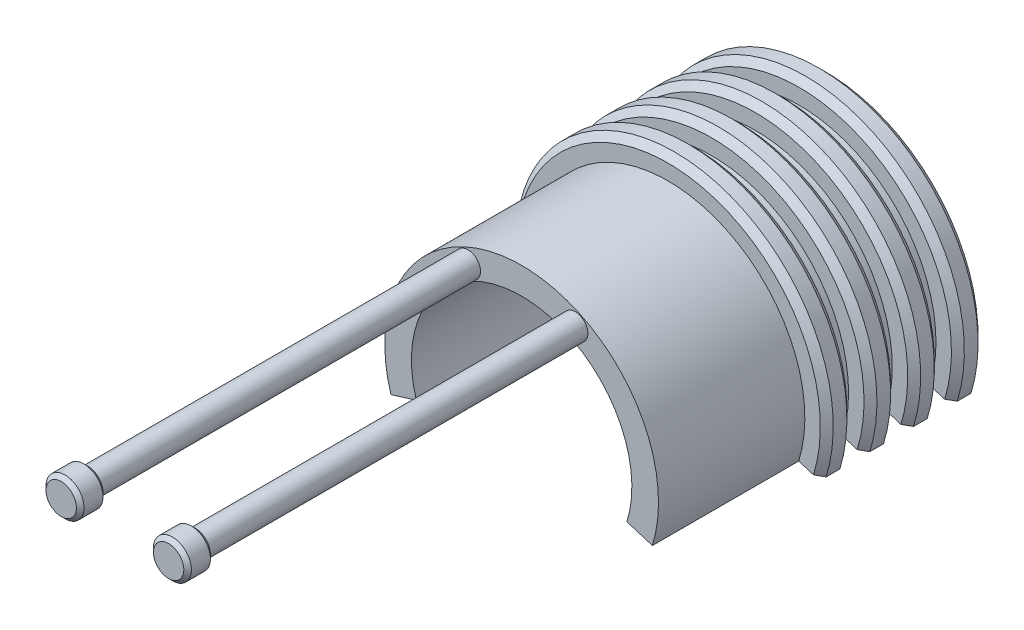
ISO-10303-21;
HEADER;
FILE_DESCRIPTION(('STEP AP214'),'2;1');
FILE_NAME('part.step','',(''),(''),'','','');
FILE_SCHEMA(('AUTOMOTIVE_DESIGN { 1 0 10303 214 1 1 1 1 }'));
ENDSEC;
DATA;
#1=APPLICATION_CONTEXT('core data for automotive mechanical design processes');
#2=APPLICATION_PROTOCOL_DEFINITION('international standard','automotive_design',2000,#1);
#3=PRODUCT_CONTEXT('',#1,'mechanical');
#4=PRODUCT('Part','Part','',(#3));
#5=PRODUCT_RELATED_PRODUCT_CATEGORY('part','',(#4));
#6=PRODUCT_DEFINITION_FORMATION('','',#4);
#7=PRODUCT_DEFINITION_CONTEXT('part definition',#1,'design');
#8=PRODUCT_DEFINITION('design','',#6,#7);
#9=PRODUCT_DEFINITION_SHAPE('','',#8);
#10=(LENGTH_UNIT() NAMED_UNIT(*) SI_UNIT(.MILLI.,.METRE.));
#11=(NAMED_UNIT(*) PLANE_ANGLE_UNIT() SI_UNIT($,.RADIAN.));
#12=(NAMED_UNIT(*) SI_UNIT($,.STERADIAN.) SOLID_ANGLE_UNIT());
#13=UNCERTAINTY_MEASURE_WITH_UNIT(LENGTH_MEASURE(1.E-05),#10,'distance_accuracy_value','');
#14=(GEOMETRIC_REPRESENTATION_CONTEXT(3) GLOBAL_UNCERTAINTY_ASSIGNED_CONTEXT((#13)) GLOBAL_UNIT_ASSIGNED_CONTEXT((#10,
#11,#12)) REPRESENTATION_CONTEXT('',''));
#15=CARTESIAN_POINT('',(0.,0.,0.));
#16=DIRECTION('',(0.,0.,1.));
#17=DIRECTION('',(1.,0.,0.));
#18=AXIS2_PLACEMENT_3D('',#15,#16,#17);
#19=CARTESIAN_POINT('',(0.,0.,80.));
#20=DIRECTION('',(0.,0.,-1.));
#21=DIRECTION('',(-1.,0.,0.));
#22=AXIS2_PLACEMENT_3D('',#19,#20,#21);
#23=CYLINDRICAL_SURFACE('',#22,36.);
#24=CARTESIAN_POINT('',(0.,0.,41.5));
#25=DIRECTION('',(0.,0.,1.));
#26=DIRECTION('',(-1.,0.,0.));
#27=AXIS2_PLACEMENT_3D('',#24,#25,#26);
#28=CIRCLE('',#27,36.);
#29=CARTESIAN_POINT('',(34.3887413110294,-10.6496230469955,41.5));
#30=VERTEX_POINT('',#29);
#31=CARTESIAN_POINT('',(-34.3887413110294,-10.6496230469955,41.5));
#32=VERTEX_POINT('',#31);
#33=EDGE_CURVE('E221',#30,#32,#28,.T.);
#34=ORIENTED_EDGE('',*,*,#33,.T.);
#35=DIRECTION('',(0.,0.,-1.));
#36=VECTOR('',#35,1.);
#37=CARTESIAN_POINT('',(-34.3887413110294,-10.6496230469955,80.));
#38=LINE('',#37,#36);
#39=CARTESIAN_POINT('',(-34.3887413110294,-10.6496230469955,80.));
#40=VERTEX_POINT('',#39);
#41=EDGE_CURVE('E230',#40,#32,#38,.T.);
#42=ORIENTED_EDGE('',*,*,#41,.F.);
#43=CARTESIAN_POINT('',(0.,0.,80.));
#44=DIRECTION('',(0.,0.,1.));
#45=DIRECTION('',(1.,0.,0.));
#46=AXIS2_PLACEMENT_3D('',#43,#44,#45);
#47=CIRCLE('',#46,36.);
#48=CARTESIAN_POINT('',(34.3887413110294,-10.6496230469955,80.));
#49=VERTEX_POINT('',#48);
#50=EDGE_CURVE('E257',#49,#40,#47,.T.);
#51=ORIENTED_EDGE('',*,*,#50,.F.);
#52=DIRECTION('',(0.,0.,-1.));
#53=VECTOR('',#52,1.);
#54=CARTESIAN_POINT('',(34.3887413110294,-10.6496230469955,80.));
#55=LINE('',#54,#53);
#56=EDGE_CURVE('E233',#49,#30,#55,.T.);
#57=ORIENTED_EDGE('',*,*,#56,.T.);
#58=EDGE_LOOP('',(#34,#42,#51,#57));
#59=FACE_BOUND('',#58,.T.);
#60=ADVANCED_FACE('F44',(#59),#23,.T.);
#61=CARTESIAN_POINT('',(-34.3887413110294,-10.6496230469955,34.5));
#62=VERTEX_POINT('',#61);
#63=CARTESIAN_POINT('',(-34.3887413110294,-10.6496230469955,30.));
#64=VERTEX_POINT('',#63);
#65=EDGE_CURVE('E240',#62,#64,#38,.T.);
#66=ORIENTED_EDGE('',*,*,#65,.F.);
#67=CARTESIAN_POINT('',(0.,0.,34.5));
#68=DIRECTION('',(0.,0.,1.));
#69=DIRECTION('',(-1.,0.,0.));
#70=AXIS2_PLACEMENT_3D('',#67,#68,#69);
#71=CIRCLE('',#70,36.);
#72=CARTESIAN_POINT('',(34.3887413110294,-10.6496230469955,34.5));
#73=VERTEX_POINT('',#72);
#74=EDGE_CURVE('E348',#73,#62,#71,.T.);
#75=ORIENTED_EDGE('',*,*,#74,.F.);
#76=CARTESIAN_POINT('',(34.3887413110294,-10.6496230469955,30.));
#77=VERTEX_POINT('',#76);
#78=EDGE_CURVE('E503',#73,#77,#55,.T.);
#79=ORIENTED_EDGE('',*,*,#78,.T.);
#80=CARTESIAN_POINT('',(0.,0.,30.));
#81=DIRECTION('',(0.,0.,1.));
#82=DIRECTION('',(-1.,0.,0.));
#83=AXIS2_PLACEMENT_3D('',#80,#81,#82);
#84=CIRCLE('',#83,36.);
#85=EDGE_CURVE('E328',#77,#64,#84,.T.);
#86=ORIENTED_EDGE('',*,*,#85,.T.);
#87=EDGE_LOOP('',(#66,#75,#79,#86));
#88=FACE_BOUND('',#87,.T.);
#89=ADVANCED_FACE('F402',(#88),#23,.T.);
#90=CARTESIAN_POINT('',(-34.3887413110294,-10.6496230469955,23.));
#91=VERTEX_POINT('',#90);
#92=CARTESIAN_POINT('',(-34.3887413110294,-10.6496230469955,18.5));
#93=VERTEX_POINT('',#92);
#94=EDGE_CURVE('E245',#91,#93,#38,.T.);
#95=ORIENTED_EDGE('',*,*,#94,.F.);
#96=CARTESIAN_POINT('',(0.,0.,23.));
#97=DIRECTION('',(0.,0.,1.));
#98=DIRECTION('',(-1.,0.,0.));
#99=AXIS2_PLACEMENT_3D('',#96,#97,#98);
#100=CIRCLE('',#99,36.);
#101=CARTESIAN_POINT('',(34.3887413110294,-10.6496230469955,23.));
#102=VERTEX_POINT('',#101);
#103=EDGE_CURVE('E332',#102,#91,#100,.T.);
#104=ORIENTED_EDGE('',*,*,#103,.F.);
#105=CARTESIAN_POINT('',(34.3887413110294,-10.6496230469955,18.5));
#106=VERTEX_POINT('',#105);
#107=EDGE_CURVE('E243',#102,#106,#55,.T.);
#108=ORIENTED_EDGE('',*,*,#107,.T.);
#109=CARTESIAN_POINT('',(0.,0.,18.5));
#110=DIRECTION('',(0.,0.,1.));
#111=DIRECTION('',(-1.,0.,0.));
#112=AXIS2_PLACEMENT_3D('',#109,#110,#111);
#113=CIRCLE('',#112,36.);
#114=EDGE_CURVE('E307',#106,#93,#113,.T.);
#115=ORIENTED_EDGE('',*,*,#114,.T.);
#116=EDGE_LOOP('',(#95,#104,#108,#115));
#117=FACE_BOUND('',#116,.T.);
#118=ADVANCED_FACE('F409',(#117),#23,.T.);
#119=CARTESIAN_POINT('',(-34.3887413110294,-10.6496230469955,11.5));
#120=VERTEX_POINT('',#119);
#121=CARTESIAN_POINT('',(-34.3887413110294,-10.6496230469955,6.99999999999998));
#122=VERTEX_POINT('',#121);
#123=EDGE_CURVE('E242',#120,#122,#38,.T.);
#124=ORIENTED_EDGE('',*,*,#123,.F.);
#125=CARTESIAN_POINT('',(0.,0.,11.5));
#126=DIRECTION('',(0.,0.,1.));
#127=DIRECTION('',(-1.,0.,0.));
#128=AXIS2_PLACEMENT_3D('',#125,#126,#127);
#129=CIRCLE('',#128,36.);
#130=CARTESIAN_POINT('',(34.3887413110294,-10.6496230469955,11.5));
#131=VERTEX_POINT('',#130);
#132=EDGE_CURVE('E311',#131,#120,#129,.T.);
#133=ORIENTED_EDGE('',*,*,#132,.F.);
#134=CARTESIAN_POINT('',(34.3887413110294,-10.6496230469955,6.99999999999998));
#135=VERTEX_POINT('',#134);
#136=EDGE_CURVE('E239',#131,#135,#55,.T.);
#137=ORIENTED_EDGE('',*,*,#136,.T.);
#138=CARTESIAN_POINT('',(0.,0.,6.99999999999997));
#139=DIRECTION('',(0.,0.,1.));
#140=DIRECTION('',(-1.,0.,0.));
#141=AXIS2_PLACEMENT_3D('',#138,#139,#140);
#142=CIRCLE('',#141,36.);
#143=EDGE_CURVE('E296',#135,#122,#142,.T.);
#144=ORIENTED_EDGE('',*,*,#143,.T.);
#145=EDGE_LOOP('',(#124,#133,#137,#144));
#146=FACE_BOUND('',#145,.T.);
#147=ADVANCED_FACE('F404',(#146),#23,.T.);
#148=CARTESIAN_POINT('',(0.,0.,80.));
#149=DIRECTION('',(0.,0.,-1.));
#150=DIRECTION('',(-1.,0.,0.));
#151=AXIS2_PLACEMENT_3D('',#148,#149,#150);
#152=CYLINDRICAL_SURFACE('',#151,29.);
#153=CARTESIAN_POINT('',(0.,0.,0.));
#154=DIRECTION('',(0.,0.,-1.));
#155=DIRECTION('',(1.,0.,0.));
#156=AXIS2_PLACEMENT_3D('',#153,#154,#155);
#157=CIRCLE('',#156,29.);
#158=CARTESIAN_POINT('',(-27.7020416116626,-8.57886301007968,0.));
#159=VERTEX_POINT('',#158);
#160=CARTESIAN_POINT('',(27.7020416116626,-8.57886301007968,0.));
#161=VERTEX_POINT('',#160);
#162=EDGE_CURVE('E266',#159,#161,#157,.T.);
#163=ORIENTED_EDGE('',*,*,#162,.T.);
#164=DIRECTION('',(0.,0.,-1.));
#165=VECTOR('',#164,1.);
#166=CARTESIAN_POINT('',(27.7020416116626,-8.57886301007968,80.));
#167=LINE('',#166,#165);
#168=CARTESIAN_POINT('',(27.7020416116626,-8.57886301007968,80.));
#169=VERTEX_POINT('',#168);
#170=EDGE_CURVE('E913',#169,#161,#167,.T.);
#171=ORIENTED_EDGE('',*,*,#170,.F.);
#172=CARTESIAN_POINT('',(0.,0.,80.));
#173=DIRECTION('',(0.,0.,-1.));
#174=DIRECTION('',(1.,0.,0.));
#175=AXIS2_PLACEMENT_3D('',#172,#173,#174);
#176=CIRCLE('',#175,29.);
#177=CARTESIAN_POINT('',(-27.7020416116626,-8.57886301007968,80.));
#178=VERTEX_POINT('',#177);
#179=EDGE_CURVE('E262',#178,#169,#176,.T.);
#180=ORIENTED_EDGE('',*,*,#179,.F.);
#181=DIRECTION('',(0.,0.,-1.));
#182=VECTOR('',#181,1.);
#183=CARTESIAN_POINT('',(-27.7020416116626,-8.57886301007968,80.));
#184=LINE('',#183,#182);
#185=EDGE_CURVE('E247',#178,#159,#184,.T.);
#186=ORIENTED_EDGE('',*,*,#185,.T.);
#187=EDGE_LOOP('',(#163,#171,#180,#186));
#188=FACE_BOUND('',#187,.T.);
#189=ADVANCED_FACE('F414',(#188),#152,.F.);
#190=CARTESIAN_POINT('',(34.3887413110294,-10.6496230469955,80.));
#191=DIRECTION('',(0.295822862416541,0.955242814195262,0.));
#192=DIRECTION('',(-0.955242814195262,0.295822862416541,0.));
#193=AXIS2_PLACEMENT_3D('',#190,#191,#192);
#194=PLANE('',#193);
#195=DIRECTION('',(0.,0.,-1.));
#196=VECTOR('',#195,1.);
#197=CARTESIAN_POINT('',(39.896642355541,-12.3553286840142,41.5));
#198=LINE('',#197,#196);
#199=CARTESIAN_POINT('',(39.896642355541,-12.3553286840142,39.7999999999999));
#200=VERTEX_POINT('',#199);
#201=CARTESIAN_POINT('',(39.896642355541,-12.3553286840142,36.1999999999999));
#202=VERTEX_POINT('',#201);
#203=EDGE_CURVE('E334',#200,#202,#198,.T.);
#204=ORIENTED_EDGE('',*,*,#203,.F.);
#205=DIRECTION('',(0.675458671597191,-0.209178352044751,-0.707106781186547));
#206=VECTOR('',#205,1.);
#207=CARTESIAN_POINT('',(0.,0.,81.565969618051));
#208=LINE('',#207,#206);
#209=CARTESIAN_POINT('',(38.272729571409,-11.852429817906,41.5));
#210=VERTEX_POINT('',#209);
#211=EDGE_CURVE('E353',#200,#210,#208,.F.);
#212=ORIENTED_EDGE('',*,*,#211,.T.);
#213=DIRECTION('',(-0.955242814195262,0.295822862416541,0.));
#214=VECTOR('',#213,1.);
#215=CARTESIAN_POINT('',(34.3887413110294,-10.6496230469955,41.5));
#216=LINE('',#215,#214);
#217=EDGE_CURVE('E225',#210,#30,#216,.T.);
#218=ORIENTED_EDGE('',*,*,#217,.T.);
#219=ORIENTED_EDGE('',*,*,#56,.F.);
#220=DIRECTION('',(0.955242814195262,-0.295822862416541,0.));
#221=VECTOR('',#220,1.);
#222=CARTESIAN_POINT('',(34.3887413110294,-10.6496230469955,80.));
#223=LINE('',#222,#221);
#224=EDGE_CURVE('E270',#169,#49,#223,.T.);
#225=ORIENTED_EDGE('',*,*,#224,.F.);
#226=ORIENTED_EDGE('',*,*,#170,.T.);
#227=DIRECTION('',(0.955242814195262,-0.295822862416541,0.));
#228=VECTOR('',#227,1.);
#229=CARTESIAN_POINT('',(34.3887413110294,-10.6496230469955,0.));
#230=LINE('',#229,#228);
#231=CARTESIAN_POINT('',(38.2727295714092,-11.8524298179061,0.));
#232=VERTEX_POINT('',#231);
#233=EDGE_CURVE('E263',#161,#232,#230,.T.);
#234=ORIENTED_EDGE('',*,*,#233,.T.);
#235=DIRECTION('',(-0.675458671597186,0.209178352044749,-0.707106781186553));
#236=VECTOR('',#235,1.);
#237=CARTESIAN_POINT('',(0.,0.,-40.0659696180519));
#238=LINE('',#237,#236);
#239=CARTESIAN_POINT('',(39.896642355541,-12.3553286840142,1.69999999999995));
#240=VERTEX_POINT('',#239);
#241=EDGE_CURVE('E919',#232,#240,#238,.F.);
#242=ORIENTED_EDGE('',*,*,#241,.T.);
#243=DIRECTION('',(0.,0.,-1.));
#244=VECTOR('',#243,1.);
#245=CARTESIAN_POINT('',(39.896642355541,-12.3553286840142,6.99999999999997));
#246=LINE('',#245,#244);
#247=CARTESIAN_POINT('',(39.896642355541,-12.3553286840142,5.2999999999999));
#248=VERTEX_POINT('',#247);
#249=EDGE_CURVE('E283',#248,#240,#246,.T.);
#250=ORIENTED_EDGE('',*,*,#249,.F.);
#251=DIRECTION('',(0.675458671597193,-0.209178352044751,-0.707106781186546));
#252=VECTOR('',#251,1.);
#253=CARTESIAN_POINT('',(0.,0.,47.0659696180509));
#254=LINE('',#253,#252);
#255=CARTESIAN_POINT('',(38.272729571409,-11.8524298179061,6.99999999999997));
#256=VERTEX_POINT('',#255);
#257=EDGE_CURVE('E921',#248,#256,#254,.F.);
#258=ORIENTED_EDGE('',*,*,#257,.T.);
#259=DIRECTION('',(-0.955242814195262,0.295822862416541,0.));
#260=VECTOR('',#259,1.);
#261=CARTESIAN_POINT('',(34.3887413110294,-10.6496230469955,6.99999999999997));
#262=LINE('',#261,#260);
#263=EDGE_CURVE('E289',#256,#135,#262,.T.);
#264=ORIENTED_EDGE('',*,*,#263,.T.);
#265=ORIENTED_EDGE('',*,*,#136,.F.);
#266=DIRECTION('',(-0.955242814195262,0.295822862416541,0.));
#267=VECTOR('',#266,1.);
#268=CARTESIAN_POINT('',(34.3887413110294,-10.6496230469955,11.5));
#269=LINE('',#268,#267);
#270=CARTESIAN_POINT('',(38.2727295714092,-11.8524298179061,11.5));
#271=VERTEX_POINT('',#270);
#272=EDGE_CURVE('E305',#271,#131,#269,.T.);
#273=ORIENTED_EDGE('',*,*,#272,.F.);
#274=DIRECTION('',(-0.675458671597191,0.209178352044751,-0.707106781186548));
#275=VECTOR('',#274,1.);
#276=CARTESIAN_POINT('',(0.,0.,-28.5659696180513));
#277=LINE('',#276,#275);
#278=CARTESIAN_POINT('',(39.896642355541,-12.3553286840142,13.1999999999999));
#279=VERTEX_POINT('',#278);
#280=EDGE_CURVE('E453',#271,#279,#277,.F.);
#281=ORIENTED_EDGE('',*,*,#280,.T.);
#282=DIRECTION('',(0.,0.,-1.));
#283=VECTOR('',#282,1.);
#284=CARTESIAN_POINT('',(39.896642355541,-12.3553286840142,18.5));
#285=LINE('',#284,#283);
#286=CARTESIAN_POINT('',(39.896642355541,-12.3553286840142,16.7999999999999));
#287=VERTEX_POINT('',#286);
#288=EDGE_CURVE('E298',#287,#279,#285,.T.);
#289=ORIENTED_EDGE('',*,*,#288,.F.);
#290=DIRECTION('',(0.675458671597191,-0.209178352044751,-0.707106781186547));
#291=VECTOR('',#290,1.);
#292=CARTESIAN_POINT('',(0.,0.,58.565969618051));
#293=LINE('',#292,#291);
#294=CARTESIAN_POINT('',(38.272729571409,-11.852429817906,18.5));
#295=VERTEX_POINT('',#294);
#296=EDGE_CURVE('E455',#287,#295,#293,.F.);
#297=ORIENTED_EDGE('',*,*,#296,.T.);
#298=DIRECTION('',(-0.955242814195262,0.295822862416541,0.));
#299=VECTOR('',#298,1.);
#300=CARTESIAN_POINT('',(34.3887413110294,-10.6496230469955,18.5));
#301=LINE('',#300,#299);
#302=EDGE_CURVE('E302',#295,#106,#301,.T.);
#303=ORIENTED_EDGE('',*,*,#302,.T.);
#304=ORIENTED_EDGE('',*,*,#107,.F.);
#305=DIRECTION('',(-0.955242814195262,0.295822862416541,0.));
#306=VECTOR('',#305,1.);
#307=CARTESIAN_POINT('',(34.3887413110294,-10.6496230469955,23.));
#308=LINE('',#307,#306);
#309=CARTESIAN_POINT('',(38.2727295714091,-11.8524298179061,23.));
#310=VERTEX_POINT('',#309);
#311=EDGE_CURVE('E326',#310,#102,#308,.T.);
#312=ORIENTED_EDGE('',*,*,#311,.F.);
#313=DIRECTION('',(-0.675458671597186,0.209178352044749,-0.707106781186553));
#314=VECTOR('',#313,1.);
#315=CARTESIAN_POINT('',(0.,0.,-17.0659696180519));
#316=LINE('',#315,#314);
#317=CARTESIAN_POINT('',(39.896642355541,-12.3553286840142,24.6999999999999));
#318=VERTEX_POINT('',#317);
#319=EDGE_CURVE('E471',#310,#318,#316,.F.);
#320=ORIENTED_EDGE('',*,*,#319,.T.);
#321=DIRECTION('',(0.,0.,-1.));
#322=VECTOR('',#321,1.);
#323=CARTESIAN_POINT('',(39.896642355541,-12.3553286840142,30.));
#324=LINE('',#323,#322);
#325=CARTESIAN_POINT('',(39.896642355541,-12.3553286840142,28.2999999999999));
#326=VERTEX_POINT('',#325);
#327=EDGE_CURVE('E313',#326,#318,#324,.T.);
#328=ORIENTED_EDGE('',*,*,#327,.F.);
#329=DIRECTION('',(0.675458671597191,-0.209178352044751,-0.707106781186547));
#330=VECTOR('',#329,1.);
#331=CARTESIAN_POINT('',(0.,0.,70.065969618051));
#332=LINE('',#331,#330);
#333=CARTESIAN_POINT('',(38.272729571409,-11.852429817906,30.));
#334=VERTEX_POINT('',#333);
#335=EDGE_CURVE('E473',#326,#334,#332,.F.);
#336=ORIENTED_EDGE('',*,*,#335,.T.);
#337=DIRECTION('',(-0.955242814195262,0.295822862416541,0.));
#338=VECTOR('',#337,1.);
#339=CARTESIAN_POINT('',(34.3887413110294,-10.6496230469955,30.));
#340=LINE('',#339,#338);
#341=EDGE_CURVE('E323',#334,#77,#340,.T.);
#342=ORIENTED_EDGE('',*,*,#341,.T.);
#343=ORIENTED_EDGE('',*,*,#78,.F.);
#344=DIRECTION('',(-0.955242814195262,0.295822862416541,0.));
#345=VECTOR('',#344,1.);
#346=CARTESIAN_POINT('',(34.3887413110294,-10.6496230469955,34.5));
#347=LINE('',#346,#345);
#348=CARTESIAN_POINT('',(38.2727295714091,-11.8524298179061,34.5));
#349=VERTEX_POINT('',#348);
#350=EDGE_CURVE('E234',#349,#73,#347,.T.);
#351=ORIENTED_EDGE('',*,*,#350,.F.);
#352=DIRECTION('',(-0.675458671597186,0.209178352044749,-0.707106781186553));
#353=VECTOR('',#352,1.);
#354=CARTESIAN_POINT('',(0.,0.,-5.56596961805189));
#355=LINE('',#354,#353);
#356=EDGE_CURVE('E361',#349,#202,#355,.F.);
#357=ORIENTED_EDGE('',*,*,#356,.T.);
#358=EDGE_LOOP('',(#204,#212,#218,#219,#225,#226,#234,#242,#250,#258,#264,#265,#273,#281,#289,
#297,#303,#304,#312,#320,#328,#336,#342,#343,#351,#357));
#359=FACE_BOUND('',#358,.T.);
#360=ADVANCED_FACE('F352',(#359),#194,.F.);
#361=CARTESIAN_POINT('',(-27.7020416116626,-8.57886301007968,80.));
#362=DIRECTION('',(-0.295822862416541,0.955242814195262,0.));
#363=DIRECTION('',(-0.955242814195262,-0.295822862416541,0.));
#364=AXIS2_PLACEMENT_3D('',#361,#362,#363);
#365=PLANE('',#364);
#366=DIRECTION('',(-0.955242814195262,-0.295822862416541,0.));
#367=VECTOR('',#366,1.);
#368=CARTESIAN_POINT('',(-34.3887413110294,-10.6496230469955,41.5));
#369=LINE('',#368,#367);
#370=CARTESIAN_POINT('',(-38.272729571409,-11.852429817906,41.5));
#371=VERTEX_POINT('',#370);
#372=EDGE_CURVE('E218',#32,#371,#369,.T.);
#373=ORIENTED_EDGE('',*,*,#372,.T.);
#374=DIRECTION('',(0.675458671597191,0.209178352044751,0.707106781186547));
#375=VECTOR('',#374,1.);
#376=CARTESIAN_POINT('',(0.,0.,81.565969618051));
#377=LINE('',#376,#375);
#378=CARTESIAN_POINT('',(-39.896642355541,-12.3553286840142,39.7999999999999));
#379=VERTEX_POINT('',#378);
#380=EDGE_CURVE('E358',#371,#379,#377,.F.);
#381=ORIENTED_EDGE('',*,*,#380,.T.);
#382=DIRECTION('',(0.,0.,-1.));
#383=VECTOR('',#382,1.);
#384=CARTESIAN_POINT('',(-39.896642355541,-12.3553286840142,41.5));
#385=LINE('',#384,#383);
#386=CARTESIAN_POINT('',(-39.896642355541,-12.3553286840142,36.1999999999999));
#387=VERTEX_POINT('',#386);
#388=EDGE_CURVE('E341',#379,#387,#385,.T.);
#389=ORIENTED_EDGE('',*,*,#388,.T.);
#390=DIRECTION('',(-0.675458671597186,-0.209178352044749,0.707106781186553));
#391=VECTOR('',#390,1.);
#392=CARTESIAN_POINT('',(0.,0.,-5.56596961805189));
#393=LINE('',#392,#391);
#394=CARTESIAN_POINT('',(-38.2727295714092,-11.8524298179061,34.5));
#395=VERTEX_POINT('',#394);
#396=EDGE_CURVE('E59',#387,#395,#393,.F.);
#397=ORIENTED_EDGE('',*,*,#396,.T.);
#398=DIRECTION('',(-0.955242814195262,-0.295822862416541,0.));
#399=VECTOR('',#398,1.);
#400=CARTESIAN_POINT('',(-34.3887413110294,-10.6496230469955,34.5));
#401=LINE('',#400,#399);
#402=EDGE_CURVE('E346',#62,#395,#401,.T.);
#403=ORIENTED_EDGE('',*,*,#402,.F.);
#404=ORIENTED_EDGE('',*,*,#65,.T.);
#405=DIRECTION('',(-0.955242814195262,-0.295822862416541,0.));
#406=VECTOR('',#405,1.);
#407=CARTESIAN_POINT('',(-34.3887413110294,-10.6496230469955,30.));
#408=LINE('',#407,#406);
#409=CARTESIAN_POINT('',(-38.272729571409,-11.852429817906,30.));
#410=VERTEX_POINT('',#409);
#411=EDGE_CURVE('E336',#64,#410,#408,.T.);
#412=ORIENTED_EDGE('',*,*,#411,.T.);
#413=DIRECTION('',(0.675458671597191,0.209178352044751,0.707106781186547));
#414=VECTOR('',#413,1.);
#415=CARTESIAN_POINT('',(0.,0.,70.065969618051));
#416=LINE('',#415,#414);
#417=CARTESIAN_POINT('',(-39.896642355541,-12.3553286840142,28.2999999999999));
#418=VERTEX_POINT('',#417);
#419=EDGE_CURVE('E479',#410,#418,#416,.F.);
#420=ORIENTED_EDGE('',*,*,#419,.T.);
#421=DIRECTION('',(0.,0.,-1.));
#422=VECTOR('',#421,1.);
#423=CARTESIAN_POINT('',(-39.896642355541,-12.3553286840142,30.));
#424=LINE('',#423,#422);
#425=CARTESIAN_POINT('',(-39.896642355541,-12.3553286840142,24.6999999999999));
#426=VERTEX_POINT('',#425);
#427=EDGE_CURVE('E320',#418,#426,#424,.T.);
#428=ORIENTED_EDGE('',*,*,#427,.T.);
#429=DIRECTION('',(-0.675458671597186,-0.209178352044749,0.707106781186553));
#430=VECTOR('',#429,1.);
#431=CARTESIAN_POINT('',(0.,0.,-17.0659696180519));
#432=LINE('',#431,#430);
#433=CARTESIAN_POINT('',(-38.2727295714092,-11.8524298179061,23.));
#434=VERTEX_POINT('',#433);
#435=EDGE_CURVE('E477',#426,#434,#432,.F.);
#436=ORIENTED_EDGE('',*,*,#435,.T.);
#437=DIRECTION('',(-0.955242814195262,-0.295822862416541,0.));
#438=VECTOR('',#437,1.);
#439=CARTESIAN_POINT('',(-34.3887413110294,-10.6496230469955,23.));
#440=LINE('',#439,#438);
#441=EDGE_CURVE('E329',#91,#434,#440,.T.);
#442=ORIENTED_EDGE('',*,*,#441,.F.);
#443=ORIENTED_EDGE('',*,*,#94,.T.);
#444=DIRECTION('',(-0.955242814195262,-0.295822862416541,0.));
#445=VECTOR('',#444,1.);
#446=CARTESIAN_POINT('',(-34.3887413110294,-10.6496230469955,18.5));
#447=LINE('',#446,#445);
#448=CARTESIAN_POINT('',(-38.272729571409,-11.852429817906,18.5));
#449=VERTEX_POINT('',#448);
#450=EDGE_CURVE('E315',#93,#449,#447,.T.);
#451=ORIENTED_EDGE('',*,*,#450,.T.);
#452=DIRECTION('',(0.675458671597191,0.209178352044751,0.707106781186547));
#453=VECTOR('',#452,1.);
#454=CARTESIAN_POINT('',(0.,0.,58.565969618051));
#455=LINE('',#454,#453);
#456=CARTESIAN_POINT('',(-39.896642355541,-12.3553286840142,16.7999999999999));
#457=VERTEX_POINT('',#456);
#458=EDGE_CURVE('E461',#449,#457,#455,.F.);
#459=ORIENTED_EDGE('',*,*,#458,.T.);
#460=DIRECTION('',(0.,0.,-1.));
#461=VECTOR('',#460,1.);
#462=CARTESIAN_POINT('',(-39.896642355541,-12.3553286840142,18.5));
#463=LINE('',#462,#461);
#464=CARTESIAN_POINT('',(-39.896642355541,-12.3553286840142,13.1999999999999));
#465=VERTEX_POINT('',#464);
#466=EDGE_CURVE('E299',#457,#465,#463,.T.);
#467=ORIENTED_EDGE('',*,*,#466,.T.);
#468=DIRECTION('',(-0.675458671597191,-0.209178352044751,0.707106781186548));
#469=VECTOR('',#468,1.);
#470=CARTESIAN_POINT('',(0.,0.,-28.5659696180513));
#471=LINE('',#470,#469);
#472=CARTESIAN_POINT('',(-38.2727295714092,-11.8524298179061,11.5));
#473=VERTEX_POINT('',#472);
#474=EDGE_CURVE('E459',#465,#473,#471,.F.);
#475=ORIENTED_EDGE('',*,*,#474,.T.);
#476=DIRECTION('',(-0.955242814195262,-0.295822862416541,0.));
#477=VECTOR('',#476,1.);
#478=CARTESIAN_POINT('',(-34.3887413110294,-10.6496230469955,11.5));
#479=LINE('',#478,#477);
#480=EDGE_CURVE('E308',#120,#473,#479,.T.);
#481=ORIENTED_EDGE('',*,*,#480,.F.);
#482=ORIENTED_EDGE('',*,*,#123,.T.);
#483=DIRECTION('',(-0.955242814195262,-0.295822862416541,0.));
#484=VECTOR('',#483,1.);
#485=CARTESIAN_POINT('',(-34.3887413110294,-10.6496230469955,6.99999999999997));
#486=LINE('',#485,#484);
#487=CARTESIAN_POINT('',(-38.272729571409,-11.852429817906,6.99999999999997));
#488=VERTEX_POINT('',#487);
#489=EDGE_CURVE('E294',#122,#488,#486,.T.);
#490=ORIENTED_EDGE('',*,*,#489,.T.);
#491=DIRECTION('',(0.675458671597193,0.209178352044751,0.707106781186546));
#492=VECTOR('',#491,1.);
#493=CARTESIAN_POINT('',(0.,0.,47.0659696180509));
#494=LINE('',#493,#492);
#495=CARTESIAN_POINT('',(-39.896642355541,-12.3553286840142,5.2999999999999));
#496=VERTEX_POINT('',#495);
#497=EDGE_CURVE('E433',#488,#496,#494,.F.);
#498=ORIENTED_EDGE('',*,*,#497,.T.);
#499=DIRECTION('',(0.,0.,-1.));
#500=VECTOR('',#499,1.);
#501=CARTESIAN_POINT('',(-39.896642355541,-12.3553286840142,6.99999999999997));
#502=LINE('',#501,#500);
#503=CARTESIAN_POINT('',(-39.896642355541,-12.3553286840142,1.69999999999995));
#504=VERTEX_POINT('',#503);
#505=EDGE_CURVE('E286',#496,#504,#502,.T.);
#506=ORIENTED_EDGE('',*,*,#505,.T.);
#507=DIRECTION('',(-0.675458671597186,-0.209178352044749,0.707106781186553));
#508=VECTOR('',#507,1.);
#509=CARTESIAN_POINT('',(0.,0.,-40.0659696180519));
#510=LINE('',#509,#508);
#511=CARTESIAN_POINT('',(-38.2727295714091,-11.8524298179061,0.));
#512=VERTEX_POINT('',#511);
#513=EDGE_CURVE('E441',#504,#512,#510,.F.);
#514=ORIENTED_EDGE('',*,*,#513,.T.);
#515=DIRECTION('',(0.955242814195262,0.295822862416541,0.));
#516=VECTOR('',#515,1.);
#517=CARTESIAN_POINT('',(-27.7020416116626,-8.57886301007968,0.));
#518=LINE('',#517,#516);
#519=EDGE_CURVE('E260',#512,#159,#518,.T.);
#520=ORIENTED_EDGE('',*,*,#519,.T.);
#521=ORIENTED_EDGE('',*,*,#185,.F.);
#522=DIRECTION('',(0.955242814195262,0.295822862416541,0.));
#523=VECTOR('',#522,1.);
#524=CARTESIAN_POINT('',(-27.7020416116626,-8.57886301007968,80.));
#525=LINE('',#524,#523);
#526=EDGE_CURVE('E238',#40,#178,#525,.T.);
#527=ORIENTED_EDGE('',*,*,#526,.F.);
#528=ORIENTED_EDGE('',*,*,#41,.T.);
#529=EDGE_LOOP('',(#373,#381,#389,#397,#403,#404,#412,#420,#428,#436,#442,#443,#451,#459,#467,
#475,#481,#482,#490,#498,#506,#514,#520,#521,#527,#528));
#530=FACE_BOUND('',#529,.T.);
#531=ADVANCED_FACE('F236',(#530),#365,.F.);
#532=CARTESIAN_POINT('',(0.,0.,80.));
#533=DIRECTION('',(0.,0.,1.));
#534=DIRECTION('',(1.,0.,0.));
#535=AXIS2_PLACEMENT_3D('',#532,#533,#534);
#536=PLANE('',#535);
#537=CARTESIAN_POINT('',(-14.1275361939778,29.1923893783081,80.));
#538=DIRECTION('',(0.,0.,1.));
#539=DIRECTION('',(1.,0.,0.));
#540=AXIS2_PLACEMENT_3D('',#537,#538,#539);
#541=CIRCLE('',#540,3.3);
#542=CARTESIAN_POINT('',(-10.8275361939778,29.1923893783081,80.));
#543=VERTEX_POINT('',#542);
#544=EDGE_CURVE('E277',#543,#543,#541,.T.);
#545=ORIENTED_EDGE('',*,*,#544,.F.);
#546=EDGE_LOOP('',(#545));
#547=FACE_BOUND('',#546,.T.);
#548=CARTESIAN_POINT('',(14.1275361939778,29.1923893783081,80.));
#549=DIRECTION('',(0.,0.,1.));
#550=DIRECTION('',(1.,0.,0.));
#551=AXIS2_PLACEMENT_3D('',#548,#549,#550);
#552=CIRCLE('',#551,3.3);
#553=CARTESIAN_POINT('',(17.4275361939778,29.1923893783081,80.));
#554=VERTEX_POINT('',#553);
#555=EDGE_CURVE('E274',#554,#554,#552,.T.);
#556=ORIENTED_EDGE('',*,*,#555,.F.);
#557=EDGE_LOOP('',(#556));
#558=FACE_BOUND('',#557,.T.);
#559=ORIENTED_EDGE('',*,*,#179,.T.);
#560=ORIENTED_EDGE('',*,*,#224,.T.);
#561=ORIENTED_EDGE('',*,*,#50,.T.);
#562=ORIENTED_EDGE('',*,*,#526,.T.);
#563=EDGE_LOOP('',(#559,#560,#561,#562));
#564=FACE_BOUND('',#563,.T.);
#565=ADVANCED_FACE('F578',(#547,#558,#564),#536,.T.);
#566=CARTESIAN_POINT('',(0.,0.,0.));
#567=DIRECTION('',(0.,0.,1.));
#568=DIRECTION('',(1.,0.,0.));
#569=AXIS2_PLACEMENT_3D('',#566,#567,#568);
#570=PLANE('',#569);
#571=ORIENTED_EDGE('',*,*,#519,.F.);
#572=CARTESIAN_POINT('',(0.,0.,0.));
#573=DIRECTION('',(0.,0.,1.));
#574=DIRECTION('',(1.,0.,0.));
#575=AXIS2_PLACEMENT_3D('',#572,#573,#574);
#576=CIRCLE('',#575,40.0659696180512);
#577=EDGE_CURVE('E440',#512,#232,#576,.F.);
#578=ORIENTED_EDGE('',*,*,#577,.T.);
#579=ORIENTED_EDGE('',*,*,#233,.F.);
#580=ORIENTED_EDGE('',*,*,#162,.F.);
#581=EDGE_LOOP('',(#571,#578,#579,#580));
#582=FACE_BOUND('',#581,.T.);
#583=ADVANCED_FACE('F576',(#582),#570,.F.);
#584=CARTESIAN_POINT('',(14.1275361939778,29.1923893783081,180.));
#585=DIRECTION('',(0.,0.,-1.));
#586=DIRECTION('',(-1.,0.,0.));
#587=AXIS2_PLACEMENT_3D('',#584,#585,#586);
#588=CYLINDRICAL_SURFACE('',#587,3.3);
#589=CARTESIAN_POINT('',(14.1275361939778,29.1923893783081,180.));
#590=DIRECTION('',(0.,0.,1.));
#591=DIRECTION('',(1.,0.,0.));
#592=AXIS2_PLACEMENT_3D('',#589,#590,#591);
#593=CIRCLE('',#592,3.3);
#594=CARTESIAN_POINT('',(17.4275361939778,29.1923893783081,180.));
#595=VERTEX_POINT('',#594);
#596=EDGE_CURVE('E267',#595,#595,#593,.T.);
#597=ORIENTED_EDGE('',*,*,#596,.F.);
#598=EDGE_LOOP('',(#597));
#599=FACE_BOUND('',#598,.T.);
#600=ORIENTED_EDGE('',*,*,#555,.T.);
#601=EDGE_LOOP('',(#600));
#602=FACE_BOUND('',#601,.T.);
#603=ADVANCED_FACE('F572',(#599,#602),#588,.T.);
#604=CARTESIAN_POINT('',(-14.1275361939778,29.1923893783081,180.));
#605=DIRECTION('',(0.,0.,-1.));
#606=DIRECTION('',(-1.,0.,0.));
#607=AXIS2_PLACEMENT_3D('',#604,#605,#606);
#608=CYLINDRICAL_SURFACE('',#607,3.3);
#609=ORIENTED_EDGE('',*,*,#544,.T.);
#610=EDGE_LOOP('',(#609));
#611=FACE_BOUND('',#610,.T.);
#612=CARTESIAN_POINT('',(-14.1275361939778,29.1923893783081,180.));
#613=DIRECTION('',(0.,0.,1.));
#614=DIRECTION('',(1.,0.,0.));
#615=AXIS2_PLACEMENT_3D('',#612,#613,#614);
#616=CIRCLE('',#615,3.3);
#617=CARTESIAN_POINT('',(-10.8275361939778,29.1923893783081,180.));
#618=VERTEX_POINT('',#617);
#619=EDGE_CURVE('E280',#618,#618,#616,.T.);
#620=ORIENTED_EDGE('',*,*,#619,.F.);
#621=EDGE_LOOP('',(#620));
#622=FACE_BOUND('',#621,.T.);
#623=ADVANCED_FACE('F568',(#611,#622),#608,.T.);
#624=CARTESIAN_POINT('',(0.,0.,6.99999999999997));
#625=DIRECTION('',(0.,0.,-1.));
#626=DIRECTION('',(-1.,0.,0.));
#627=AXIS2_PLACEMENT_3D('',#624,#625,#626);
#628=CYLINDRICAL_SURFACE('',#627,41.7659696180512);
#629=ORIENTED_EDGE('',*,*,#505,.F.);
#630=CARTESIAN_POINT('',(0.,0.,5.2999999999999));
#631=DIRECTION('',(0.,0.,-1.));
#632=DIRECTION('',(-1.,0.,0.));
#633=AXIS2_PLACEMENT_3D('',#630,#631,#632);
#634=CIRCLE('',#633,41.7659696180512);
#635=EDGE_CURVE('E439',#496,#248,#634,.T.);
#636=ORIENTED_EDGE('',*,*,#635,.T.);
#637=ORIENTED_EDGE('',*,*,#249,.T.);
#638=CARTESIAN_POINT('',(0.,0.,1.69999999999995));
#639=DIRECTION('',(0.,0.,1.));
#640=DIRECTION('',(1.,0.,0.));
#641=AXIS2_PLACEMENT_3D('',#638,#639,#640);
#642=CIRCLE('',#641,41.7659696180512);
#643=EDGE_CURVE('E914',#240,#504,#642,.T.);
#644=ORIENTED_EDGE('',*,*,#643,.T.);
#645=EDGE_LOOP('',(#629,#636,#637,#644));
#646=FACE_BOUND('',#645,.T.);
#647=ADVANCED_FACE('F565',(#646),#628,.T.);
#648=CARTESIAN_POINT('',(0.,0.,6.99999999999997));
#649=DIRECTION('',(0.,0.,-1.));
#650=DIRECTION('',(-1.,0.,0.));
#651=AXIS2_PLACEMENT_3D('',#648,#649,#650);
#652=PLANE('',#651);
#653=ORIENTED_EDGE('',*,*,#263,.F.);
#654=CARTESIAN_POINT('',(0.,0.,6.99999999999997));
#655=DIRECTION('',(0.,0.,-1.));
#656=DIRECTION('',(-1.,0.,0.));
#657=AXIS2_PLACEMENT_3D('',#654,#655,#656);
#658=CIRCLE('',#657,40.0659696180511);
#659=EDGE_CURVE('E431',#256,#488,#658,.F.);
#660=ORIENTED_EDGE('',*,*,#659,.T.);
#661=ORIENTED_EDGE('',*,*,#489,.F.);
#662=ORIENTED_EDGE('',*,*,#143,.F.);
#663=EDGE_LOOP('',(#653,#660,#661,#662));
#664=FACE_BOUND('',#663,.T.);
#665=ADVANCED_FACE('F429',(#664),#652,.F.);
#666=CARTESIAN_POINT('',(0.,0.,5.2999999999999));
#667=DIRECTION('',(0.,0.,-1.));
#668=DIRECTION('',(-1.,0.,0.));
#669=AXIS2_PLACEMENT_3D('',#666,#667,#668);
#670=CONICAL_SURFACE('',#669,41.7659696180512,0.78539816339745);
#671=ORIENTED_EDGE('',*,*,#497,.F.);
#672=ORIENTED_EDGE('',*,*,#659,.F.);
#673=ORIENTED_EDGE('',*,*,#257,.F.);
#674=ORIENTED_EDGE('',*,*,#635,.F.);
#675=EDGE_LOOP('',(#671,#672,#673,#674));
#676=FACE_BOUND('',#675,.T.);
#677=ADVANCED_FACE('F437',(#676),#670,.T.);
#678=CARTESIAN_POINT('',(0.,0.,0.));
#679=DIRECTION('',(0.,0.,1.));
#680=DIRECTION('',(1.,0.,0.));
#681=AXIS2_PLACEMENT_3D('',#678,#679,#680);
#682=CONICAL_SURFACE('',#681,40.0659696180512,0.78539816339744);
#683=ORIENTED_EDGE('',*,*,#513,.F.);
#684=ORIENTED_EDGE('',*,*,#643,.F.);
#685=ORIENTED_EDGE('',*,*,#241,.F.);
#686=ORIENTED_EDGE('',*,*,#577,.F.);
#687=EDGE_LOOP('',(#683,#684,#685,#686));
#688=FACE_BOUND('',#687,.T.);
#689=ADVANCED_FACE('F562',(#688),#682,.T.);
#690=CARTESIAN_POINT('',(0.,0.,18.5));
#691=DIRECTION('',(0.,0.,-1.));
#692=DIRECTION('',(-1.,0.,0.));
#693=AXIS2_PLACEMENT_3D('',#690,#691,#692);
#694=CYLINDRICAL_SURFACE('',#693,41.7659696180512);
#695=ORIENTED_EDGE('',*,*,#466,.F.);
#696=CARTESIAN_POINT('',(0.,0.,16.7999999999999));
#697=DIRECTION('',(0.,0.,-1.));
#698=DIRECTION('',(-1.,0.,0.));
#699=AXIS2_PLACEMENT_3D('',#696,#697,#698);
#700=CIRCLE('',#699,41.7659696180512);
#701=EDGE_CURVE('E450',#457,#287,#700,.T.);
#702=ORIENTED_EDGE('',*,*,#701,.T.);
#703=ORIENTED_EDGE('',*,*,#288,.T.);
#704=CARTESIAN_POINT('',(0.,0.,13.1999999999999));
#705=DIRECTION('',(0.,0.,-1.));
#706=DIRECTION('',(-1.,0.,0.));
#707=AXIS2_PLACEMENT_3D('',#704,#705,#706);
#708=CIRCLE('',#707,41.7659696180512);
#709=EDGE_CURVE('E444',#279,#465,#708,.F.);
#710=ORIENTED_EDGE('',*,*,#709,.T.);
#711=EDGE_LOOP('',(#695,#702,#703,#710));
#712=FACE_BOUND('',#711,.T.);
#713=ADVANCED_FACE('F542',(#712),#694,.T.);
#714=CARTESIAN_POINT('',(0.,0.,18.5));
#715=DIRECTION('',(0.,0.,-1.));
#716=DIRECTION('',(-1.,0.,0.));
#717=AXIS2_PLACEMENT_3D('',#714,#715,#716);
#718=PLANE('',#717);
#719=ORIENTED_EDGE('',*,*,#302,.F.);
#720=CARTESIAN_POINT('',(0.,0.,18.5));
#721=DIRECTION('',(0.,0.,-1.));
#722=DIRECTION('',(-1.,0.,0.));
#723=AXIS2_PLACEMENT_3D('',#720,#721,#722);
#724=CIRCLE('',#723,40.0659696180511);
#725=EDGE_CURVE('E457',#295,#449,#724,.F.);
#726=ORIENTED_EDGE('',*,*,#725,.T.);
#727=ORIENTED_EDGE('',*,*,#450,.F.);
#728=ORIENTED_EDGE('',*,*,#114,.F.);
#729=EDGE_LOOP('',(#719,#726,#727,#728));
#730=FACE_BOUND('',#729,.T.);
#731=ADVANCED_FACE('F533',(#730),#718,.F.);
#732=CARTESIAN_POINT('',(0.,0.,11.5));
#733=DIRECTION('',(0.,0.,-1.));
#734=DIRECTION('',(-1.,0.,0.));
#735=AXIS2_PLACEMENT_3D('',#732,#733,#734);
#736=PLANE('',#735);
#737=ORIENTED_EDGE('',*,*,#480,.T.);
#738=CARTESIAN_POINT('',(0.,0.,11.5));
#739=DIRECTION('',(0.,0.,-1.));
#740=DIRECTION('',(-1.,0.,0.));
#741=AXIS2_PLACEMENT_3D('',#738,#739,#740);
#742=CIRCLE('',#741,40.0659696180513);
#743=EDGE_CURVE('E463',#473,#271,#742,.T.);
#744=ORIENTED_EDGE('',*,*,#743,.T.);
#745=ORIENTED_EDGE('',*,*,#272,.T.);
#746=ORIENTED_EDGE('',*,*,#132,.T.);
#747=EDGE_LOOP('',(#737,#744,#745,#746));
#748=FACE_BOUND('',#747,.T.);
#749=ADVANCED_FACE('F550',(#748),#736,.T.);
#750=CARTESIAN_POINT('',(0.,0.,30.));
#751=DIRECTION('',(0.,0.,-1.));
#752=DIRECTION('',(-1.,0.,0.));
#753=AXIS2_PLACEMENT_3D('',#750,#751,#752);
#754=CYLINDRICAL_SURFACE('',#753,41.7659696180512);
#755=ORIENTED_EDGE('',*,*,#427,.F.);
#756=CARTESIAN_POINT('',(0.,0.,28.2999999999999));
#757=DIRECTION('',(0.,0.,-1.));
#758=DIRECTION('',(-1.,0.,0.));
#759=AXIS2_PLACEMENT_3D('',#756,#757,#758);
#760=CIRCLE('',#759,41.7659696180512);
#761=EDGE_CURVE('E468',#418,#326,#760,.T.);
#762=ORIENTED_EDGE('',*,*,#761,.T.);
#763=ORIENTED_EDGE('',*,*,#327,.T.);
#764=CARTESIAN_POINT('',(0.,0.,24.6999999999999));
#765=DIRECTION('',(0.,0.,-1.));
#766=DIRECTION('',(-1.,0.,0.));
#767=AXIS2_PLACEMENT_3D('',#764,#765,#766);
#768=CIRCLE('',#767,41.7659696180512);
#769=EDGE_CURVE('E466',#318,#426,#768,.F.);
#770=ORIENTED_EDGE('',*,*,#769,.T.);
#771=EDGE_LOOP('',(#755,#762,#763,#770));
#772=FACE_BOUND('',#771,.T.);
#773=ADVANCED_FACE('F515',(#772),#754,.T.);
#774=CARTESIAN_POINT('',(0.,0.,30.));
#775=DIRECTION('',(0.,0.,-1.));
#776=DIRECTION('',(-1.,0.,0.));
#777=AXIS2_PLACEMENT_3D('',#774,#775,#776);
#778=PLANE('',#777);
#779=ORIENTED_EDGE('',*,*,#341,.F.);
#780=CARTESIAN_POINT('',(0.,0.,30.));
#781=DIRECTION('',(0.,0.,-1.));
#782=DIRECTION('',(-1.,0.,0.));
#783=AXIS2_PLACEMENT_3D('',#780,#781,#782);
#784=CIRCLE('',#783,40.0659696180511);
#785=EDGE_CURVE('E475',#334,#410,#784,.F.);
#786=ORIENTED_EDGE('',*,*,#785,.T.);
#787=ORIENTED_EDGE('',*,*,#411,.F.);
#788=ORIENTED_EDGE('',*,*,#85,.F.);
#789=EDGE_LOOP('',(#779,#786,#787,#788));
#790=FACE_BOUND('',#789,.T.);
#791=ADVANCED_FACE('F506',(#790),#778,.F.);
#792=CARTESIAN_POINT('',(0.,0.,23.));
#793=DIRECTION('',(0.,0.,-1.));
#794=DIRECTION('',(-1.,0.,0.));
#795=AXIS2_PLACEMENT_3D('',#792,#793,#794);
#796=PLANE('',#795);
#797=ORIENTED_EDGE('',*,*,#441,.T.);
#798=CARTESIAN_POINT('',(0.,0.,23.));
#799=DIRECTION('',(0.,0.,-1.));
#800=DIRECTION('',(-1.,0.,0.));
#801=AXIS2_PLACEMENT_3D('',#798,#799,#800);
#802=CIRCLE('',#801,40.0659696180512);
#803=EDGE_CURVE('E481',#434,#310,#802,.T.);
#804=ORIENTED_EDGE('',*,*,#803,.T.);
#805=ORIENTED_EDGE('',*,*,#311,.T.);
#806=ORIENTED_EDGE('',*,*,#103,.T.);
#807=EDGE_LOOP('',(#797,#804,#805,#806));
#808=FACE_BOUND('',#807,.T.);
#809=ADVANCED_FACE('F524',(#808),#796,.T.);
#810=CARTESIAN_POINT('',(0.,0.,41.5));
#811=DIRECTION('',(0.,0.,-1.));
#812=DIRECTION('',(-1.,0.,0.));
#813=AXIS2_PLACEMENT_3D('',#810,#811,#812);
#814=CYLINDRICAL_SURFACE('',#813,41.7659696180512);
#815=ORIENTED_EDGE('',*,*,#388,.F.);
#816=CARTESIAN_POINT('',(0.,0.,39.7999999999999));
#817=DIRECTION('',(0.,0.,-1.));
#818=DIRECTION('',(-1.,0.,0.));
#819=AXIS2_PLACEMENT_3D('',#816,#817,#818);
#820=CIRCLE('',#819,41.7659696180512);
#821=EDGE_CURVE('E486',#379,#200,#820,.T.);
#822=ORIENTED_EDGE('',*,*,#821,.T.);
#823=ORIENTED_EDGE('',*,*,#203,.T.);
#824=CARTESIAN_POINT('',(0.,0.,36.1999999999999));
#825=DIRECTION('',(0.,0.,-1.));
#826=DIRECTION('',(-1.,0.,0.));
#827=AXIS2_PLACEMENT_3D('',#824,#825,#826);
#828=CIRCLE('',#827,41.7659696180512);
#829=EDGE_CURVE('E484',#202,#387,#828,.F.);
#830=ORIENTED_EDGE('',*,*,#829,.T.);
#831=EDGE_LOOP('',(#815,#822,#823,#830));
#832=FACE_BOUND('',#831,.T.);
#833=ADVANCED_FACE('F494',(#832),#814,.T.);
#834=CARTESIAN_POINT('',(0.,0.,41.5));
#835=DIRECTION('',(0.,0.,-1.));
#836=DIRECTION('',(-1.,0.,0.));
#837=AXIS2_PLACEMENT_3D('',#834,#835,#836);
#838=PLANE('',#837);
#839=ORIENTED_EDGE('',*,*,#217,.F.);
#840=CARTESIAN_POINT('',(0.,0.,41.5));
#841=DIRECTION('',(0.,0.,-1.));
#842=DIRECTION('',(-1.,0.,0.));
#843=AXIS2_PLACEMENT_3D('',#840,#841,#842);
#844=CIRCLE('',#843,40.0659696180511);
#845=EDGE_CURVE('E67',#210,#371,#844,.F.);
#846=ORIENTED_EDGE('',*,*,#845,.T.);
#847=ORIENTED_EDGE('',*,*,#372,.F.);
#848=ORIENTED_EDGE('',*,*,#33,.F.);
#849=EDGE_LOOP('',(#839,#846,#847,#848));
#850=FACE_BOUND('',#849,.T.);
#851=ADVANCED_FACE('F220',(#850),#838,.F.);
#852=CARTESIAN_POINT('',(0.,0.,34.5));
#853=DIRECTION('',(0.,0.,-1.));
#854=DIRECTION('',(-1.,0.,0.));
#855=AXIS2_PLACEMENT_3D('',#852,#853,#854);
#856=PLANE('',#855);
#857=ORIENTED_EDGE('',*,*,#402,.T.);
#858=CARTESIAN_POINT('',(0.,0.,34.5));
#859=DIRECTION('',(0.,0.,-1.));
#860=DIRECTION('',(-1.,0.,0.));
#861=AXIS2_PLACEMENT_3D('',#858,#859,#860);
#862=CIRCLE('',#861,40.0659696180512);
#863=EDGE_CURVE('E366',#395,#349,#862,.T.);
#864=ORIENTED_EDGE('',*,*,#863,.T.);
#865=ORIENTED_EDGE('',*,*,#350,.T.);
#866=ORIENTED_EDGE('',*,*,#74,.T.);
#867=EDGE_LOOP('',(#857,#864,#865,#866));
#868=FACE_BOUND('',#867,.T.);
#869=ADVANCED_FACE('F497',(#868),#856,.T.);
#870=CARTESIAN_POINT('',(0.,0.,16.7999999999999));
#871=DIRECTION('',(0.,0.,-1.));
#872=DIRECTION('',(-1.,0.,0.));
#873=AXIS2_PLACEMENT_3D('',#870,#871,#872);
#874=CONICAL_SURFACE('',#873,41.7659696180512,0.785398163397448);
#875=ORIENTED_EDGE('',*,*,#458,.F.);
#876=ORIENTED_EDGE('',*,*,#725,.F.);
#877=ORIENTED_EDGE('',*,*,#296,.F.);
#878=ORIENTED_EDGE('',*,*,#701,.F.);
#879=EDGE_LOOP('',(#875,#876,#877,#878));
#880=FACE_BOUND('',#879,.T.);
#881=ADVANCED_FACE('F539',(#880),#874,.T.);
#882=CARTESIAN_POINT('',(0.,0.,11.5));
#883=DIRECTION('',(0.,0.,1.));
#884=DIRECTION('',(1.,0.,0.));
#885=AXIS2_PLACEMENT_3D('',#882,#883,#884);
#886=CONICAL_SURFACE('',#885,40.0659696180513,0.785398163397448);
#887=ORIENTED_EDGE('',*,*,#474,.F.);
#888=ORIENTED_EDGE('',*,*,#709,.F.);
#889=ORIENTED_EDGE('',*,*,#280,.F.);
#890=ORIENTED_EDGE('',*,*,#743,.F.);
#891=EDGE_LOOP('',(#887,#888,#889,#890));
#892=FACE_BOUND('',#891,.T.);
#893=ADVANCED_FACE('F548',(#892),#886,.T.);
#894=CARTESIAN_POINT('',(0.,0.,28.2999999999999));
#895=DIRECTION('',(0.,0.,-1.));
#896=DIRECTION('',(-1.,0.,0.));
#897=AXIS2_PLACEMENT_3D('',#894,#895,#896);
#898=CONICAL_SURFACE('',#897,41.7659696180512,0.785398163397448);
#899=ORIENTED_EDGE('',*,*,#419,.F.);
#900=ORIENTED_EDGE('',*,*,#785,.F.);
#901=ORIENTED_EDGE('',*,*,#335,.F.);
#902=ORIENTED_EDGE('',*,*,#761,.F.);
#903=EDGE_LOOP('',(#899,#900,#901,#902));
#904=FACE_BOUND('',#903,.T.);
#905=ADVANCED_FACE('F512',(#904),#898,.T.);
#906=CARTESIAN_POINT('',(0.,0.,23.));
#907=DIRECTION('',(0.,0.,1.));
#908=DIRECTION('',(1.,0.,0.));
#909=AXIS2_PLACEMENT_3D('',#906,#907,#908);
#910=CONICAL_SURFACE('',#909,40.0659696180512,0.78539816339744);
#911=ORIENTED_EDGE('',*,*,#435,.F.);
#912=ORIENTED_EDGE('',*,*,#769,.F.);
#913=ORIENTED_EDGE('',*,*,#319,.F.);
#914=ORIENTED_EDGE('',*,*,#803,.F.);
#915=EDGE_LOOP('',(#911,#912,#913,#914));
#916=FACE_BOUND('',#915,.T.);
#917=ADVANCED_FACE('F522',(#916),#910,.T.);
#918=CARTESIAN_POINT('',(0.,0.,39.7999999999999));
#919=DIRECTION('',(0.,0.,-1.));
#920=DIRECTION('',(-1.,0.,0.));
#921=AXIS2_PLACEMENT_3D('',#918,#919,#920);
#922=CONICAL_SURFACE('',#921,41.7659696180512,0.785398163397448);
#923=ORIENTED_EDGE('',*,*,#380,.F.);
#924=ORIENTED_EDGE('',*,*,#845,.F.);
#925=ORIENTED_EDGE('',*,*,#211,.F.);
#926=ORIENTED_EDGE('',*,*,#821,.F.);
#927=EDGE_LOOP('',(#923,#924,#925,#926));
#928=FACE_BOUND('',#927,.T.);
#929=ADVANCED_FACE('F355',(#928),#922,.T.);
#930=CARTESIAN_POINT('',(0.,0.,34.5));
#931=DIRECTION('',(0.,0.,1.));
#932=DIRECTION('',(1.,0.,0.));
#933=AXIS2_PLACEMENT_3D('',#930,#931,#932);
#934=CONICAL_SURFACE('',#933,40.0659696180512,0.78539816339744);
#935=ORIENTED_EDGE('',*,*,#396,.F.);
#936=ORIENTED_EDGE('',*,*,#829,.F.);
#937=ORIENTED_EDGE('',*,*,#356,.F.);
#938=ORIENTED_EDGE('',*,*,#863,.F.);
#939=EDGE_LOOP('',(#935,#936,#937,#938));
#940=FACE_BOUND('',#939,.T.);
#941=ADVANCED_FACE('F495',(#940),#934,.T.);
#942=CARTESIAN_POINT('',(-14.1275361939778,29.1923893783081,187.));
#943=DIRECTION('',(0.,0.,-1.));
#944=DIRECTION('',(-1.,0.,0.));
#945=AXIS2_PLACEMENT_3D('',#942,#943,#944);
#946=CYLINDRICAL_SURFACE('',#945,5.);
#947=CARTESIAN_POINT('',(-14.1275361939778,29.1923893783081,181.));
#948=DIRECTION('',(0.,0.,1.));
#949=DIRECTION('',(1.,0.,0.));
#950=AXIS2_PLACEMENT_3D('',#947,#948,#949);
#951=CIRCLE('',#950,5.);
#952=CARTESIAN_POINT('',(-9.12753619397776,29.1923893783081,181.));
#953=VERTEX_POINT('',#952);
#954=EDGE_CURVE('E52',#953,#953,#951,.T.);
#955=ORIENTED_EDGE('',*,*,#954,.T.);
#956=EDGE_LOOP('',(#955));
#957=FACE_BOUND('',#956,.T.);
#958=CARTESIAN_POINT('',(-14.1275361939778,29.1923893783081,186.));
#959=DIRECTION('',(0.,0.,1.));
#960=DIRECTION('',(1.,0.,0.));
#961=AXIS2_PLACEMENT_3D('',#958,#959,#960);
#962=CIRCLE('',#961,5.);
#963=CARTESIAN_POINT('',(-9.12753619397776,29.1923893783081,186.));
#964=VERTEX_POINT('',#963);
#965=EDGE_CURVE('E372',#964,#964,#962,.F.);
#966=ORIENTED_EDGE('',*,*,#965,.T.);
#967=EDGE_LOOP('',(#966));
#968=FACE_BOUND('',#967,.T.);
#969=ADVANCED_FACE('F389',(#957,#968),#946,.T.);
#970=CARTESIAN_POINT('',(-14.1275361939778,29.1923893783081,187.));
#971=DIRECTION('',(0.,0.,1.));
#972=DIRECTION('',(1.,0.,0.));
#973=AXIS2_PLACEMENT_3D('',#970,#971,#972);
#974=PLANE('',#973);
#975=CARTESIAN_POINT('',(-14.1275361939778,29.1923893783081,187.));
#976=DIRECTION('',(0.,0.,1.));
#977=DIRECTION('',(1.,0.,0.));
#978=AXIS2_PLACEMENT_3D('',#975,#976,#977);
#979=CIRCLE('',#978,4.00000000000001);
#980=CARTESIAN_POINT('',(-10.1275361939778,29.1923893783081,187.));
#981=VERTEX_POINT('',#980);
#982=EDGE_CURVE('E369',#981,#981,#979,.T.);
#983=ORIENTED_EDGE('',*,*,#982,.T.);
#984=EDGE_LOOP('',(#983));
#985=FACE_BOUND('',#984,.T.);
#986=ADVANCED_FACE('F635',(#985),#974,.T.);
#987=CARTESIAN_POINT('',(-14.1275361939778,29.1923893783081,180.));
#988=DIRECTION('',(0.,0.,1.));
#989=DIRECTION('',(1.,0.,0.));
#990=AXIS2_PLACEMENT_3D('',#987,#988,#989);
#991=PLANE('',#990);
#992=CARTESIAN_POINT('',(-14.1275361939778,29.1923893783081,180.));
#993=DIRECTION('',(0.,0.,1.));
#994=DIRECTION('',(1.,0.,0.));
#995=AXIS2_PLACEMENT_3D('',#992,#993,#994);
#996=CIRCLE('',#995,4.00000000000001);
#997=CARTESIAN_POINT('',(-10.1275361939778,29.1923893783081,180.));
#998=VERTEX_POINT('',#997);
#999=EDGE_CURVE('E12',#998,#998,#996,.F.);
#1000=ORIENTED_EDGE('',*,*,#999,.T.);
#1001=EDGE_LOOP('',(#1000));
#1002=FACE_BOUND('',#1001,.T.);
#1003=ORIENTED_EDGE('',*,*,#619,.T.);
#1004=EDGE_LOOP('',(#1003));
#1005=FACE_BOUND('',#1004,.T.);
#1006=ADVANCED_FACE('F631',(#1002,#1005),#991,.F.);
#1007=CARTESIAN_POINT('',(14.1275361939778,29.1923893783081,187.));
#1008=DIRECTION('',(0.,0.,-1.));
#1009=DIRECTION('',(-1.,0.,0.));
#1010=AXIS2_PLACEMENT_3D('',#1007,#1008,#1009);
#1011=CYLINDRICAL_SURFACE('',#1010,5.);
#1012=CARTESIAN_POINT('',(14.1275361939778,29.1923893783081,186.));
#1013=DIRECTION('',(0.,0.,1.));
#1014=DIRECTION('',(1.,0.,0.));
#1015=AXIS2_PLACEMENT_3D('',#1012,#1013,#1014);
#1016=CIRCLE('',#1015,5.);
#1017=CARTESIAN_POINT('',(19.1275361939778,29.1923893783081,186.));
#1018=VERTEX_POINT('',#1017);
#1019=EDGE_CURVE('E381',#1018,#1018,#1016,.F.);
#1020=ORIENTED_EDGE('',*,*,#1019,.T.);
#1021=EDGE_LOOP('',(#1020));
#1022=FACE_BOUND('',#1021,.T.);
#1023=CARTESIAN_POINT('',(14.1275361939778,29.1923893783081,181.));
#1024=DIRECTION('',(0.,0.,1.));
#1025=DIRECTION('',(1.,0.,0.));
#1026=AXIS2_PLACEMENT_3D('',#1023,#1024,#1025);
#1027=CIRCLE('',#1026,5.);
#1028=CARTESIAN_POINT('',(19.1275361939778,29.1923893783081,181.));
#1029=VERTEX_POINT('',#1028);
#1030=EDGE_CURVE('E378',#1029,#1029,#1027,.T.);
#1031=ORIENTED_EDGE('',*,*,#1030,.T.);
#1032=EDGE_LOOP('',(#1031));
#1033=FACE_BOUND('',#1032,.T.);
#1034=ADVANCED_FACE('F623',(#1022,#1033),#1011,.T.);
#1035=CARTESIAN_POINT('',(14.1275361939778,29.1923893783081,187.));
#1036=DIRECTION('',(0.,0.,1.));
#1037=DIRECTION('',(1.,0.,0.));
#1038=AXIS2_PLACEMENT_3D('',#1035,#1036,#1037);
#1039=PLANE('',#1038);
#1040=CARTESIAN_POINT('',(14.1275361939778,29.1923893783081,187.));
#1041=DIRECTION('',(0.,0.,1.));
#1042=DIRECTION('',(1.,0.,0.));
#1043=AXIS2_PLACEMENT_3D('',#1040,#1041,#1042);
#1044=CIRCLE('',#1043,4.);
#1045=CARTESIAN_POINT('',(18.1275361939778,29.1923893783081,187.));
#1046=VERTEX_POINT('',#1045);
#1047=EDGE_CURVE('E375',#1046,#1046,#1044,.T.);
#1048=ORIENTED_EDGE('',*,*,#1047,.T.);
#1049=EDGE_LOOP('',(#1048));
#1050=FACE_BOUND('',#1049,.T.);
#1051=ADVANCED_FACE('F621',(#1050),#1039,.T.);
#1052=CARTESIAN_POINT('',(14.1275361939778,29.1923893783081,180.));
#1053=DIRECTION('',(0.,0.,1.));
#1054=DIRECTION('',(1.,0.,0.));
#1055=AXIS2_PLACEMENT_3D('',#1052,#1053,#1054);
#1056=PLANE('',#1055);
#1057=CARTESIAN_POINT('',(14.1275361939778,29.1923893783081,180.));
#1058=DIRECTION('',(0.,0.,1.));
#1059=DIRECTION('',(1.,0.,0.));
#1060=AXIS2_PLACEMENT_3D('',#1057,#1058,#1059);
#1061=CIRCLE('',#1060,4.);
#1062=CARTESIAN_POINT('',(18.1275361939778,29.1923893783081,180.));
#1063=VERTEX_POINT('',#1062);
#1064=EDGE_CURVE('E384',#1063,#1063,#1061,.F.);
#1065=ORIENTED_EDGE('',*,*,#1064,.T.);
#1066=EDGE_LOOP('',(#1065));
#1067=FACE_BOUND('',#1066,.T.);
#1068=ORIENTED_EDGE('',*,*,#596,.T.);
#1069=EDGE_LOOP('',(#1068));
#1070=FACE_BOUND('',#1069,.T.);
#1071=ADVANCED_FACE('F611',(#1067,#1070),#1056,.F.);
#1072=CARTESIAN_POINT('',(-14.1275361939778,29.1923893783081,187.));
#1073=DIRECTION('',(0.,0.,-1.));
#1074=DIRECTION('',(-1.,0.,0.));
#1075=AXIS2_PLACEMENT_3D('',#1072,#1073,#1074);
#1076=CONICAL_SURFACE('',#1075,4.00000000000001,0.785398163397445);
#1077=ORIENTED_EDGE('',*,*,#965,.F.);
#1078=EDGE_LOOP('',(#1077));
#1079=FACE_BOUND('',#1078,.T.);
#1080=ORIENTED_EDGE('',*,*,#982,.F.);
#1081=EDGE_LOOP('',(#1080));
#1082=FACE_BOUND('',#1081,.T.);
#1083=ADVANCED_FACE('F608',(#1079,#1082),#1076,.T.);
#1084=CARTESIAN_POINT('',(14.1275361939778,29.1923893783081,187.));
#1085=DIRECTION('',(0.,0.,-1.));
#1086=DIRECTION('',(-1.,0.,0.));
#1087=AXIS2_PLACEMENT_3D('',#1084,#1085,#1086);
#1088=CONICAL_SURFACE('',#1087,4.,0.785398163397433);
#1089=ORIENTED_EDGE('',*,*,#1019,.F.);
#1090=EDGE_LOOP('',(#1089));
#1091=FACE_BOUND('',#1090,.T.);
#1092=ORIENTED_EDGE('',*,*,#1047,.F.);
#1093=EDGE_LOOP('',(#1092));
#1094=FACE_BOUND('',#1093,.T.);
#1095=ADVANCED_FACE('F398',(#1091,#1094),#1088,.T.);
#1096=CARTESIAN_POINT('',(14.1275361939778,29.1923893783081,181.));
#1097=DIRECTION('',(0.,0.,1.));
#1098=DIRECTION('',(1.,0.,0.));
#1099=AXIS2_PLACEMENT_3D('',#1096,#1097,#1098);
#1100=CONICAL_SURFACE('',#1099,5.,0.785398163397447);
#1101=ORIENTED_EDGE('',*,*,#1064,.F.);
#1102=EDGE_LOOP('',(#1101));
#1103=FACE_BOUND('',#1102,.T.);
#1104=ORIENTED_EDGE('',*,*,#1030,.F.);
#1105=EDGE_LOOP('',(#1104));
#1106=FACE_BOUND('',#1105,.T.);
#1107=ADVANCED_FACE('F393',(#1103,#1106),#1100,.T.);
#1108=CARTESIAN_POINT('',(-14.1275361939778,29.1923893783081,181.));
#1109=DIRECTION('',(0.,0.,1.));
#1110=DIRECTION('',(1.,0.,0.));
#1111=AXIS2_PLACEMENT_3D('',#1108,#1109,#1110);
#1112=CONICAL_SURFACE('',#1111,5.,0.785398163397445);
#1113=ORIENTED_EDGE('',*,*,#999,.F.);
#1114=EDGE_LOOP('',(#1113));
#1115=FACE_BOUND('',#1114,.T.);
#1116=ORIENTED_EDGE('',*,*,#954,.F.);
#1117=EDGE_LOOP('',(#1116));
#1118=FACE_BOUND('',#1117,.T.);
#1119=ADVANCED_FACE('F46',(#1115,#1118),#1112,.T.);
#1120=CLOSED_SHELL('',(#60,#89,#118,#147,#189,#360,#531,#565,#583,#603,#623,#647,#665,#677,#689,
#713,#731,#749,#773,#791,#809,#833,#851,#869,#881,#893,#905,#917,#929,#941,#969,#986,#1006,
#1034,#1051,#1071,#1083,#1095,#1107,#1119));
#1121=MANIFOLD_SOLID_BREP('B2',#1120);
#1122=ADVANCED_BREP_SHAPE_REPRESENTATION('',(#18,#1121),#14);
#1123=SHAPE_DEFINITION_REPRESENTATION(#9,#1122);
ENDSEC;
END-ISO-10303-21;
